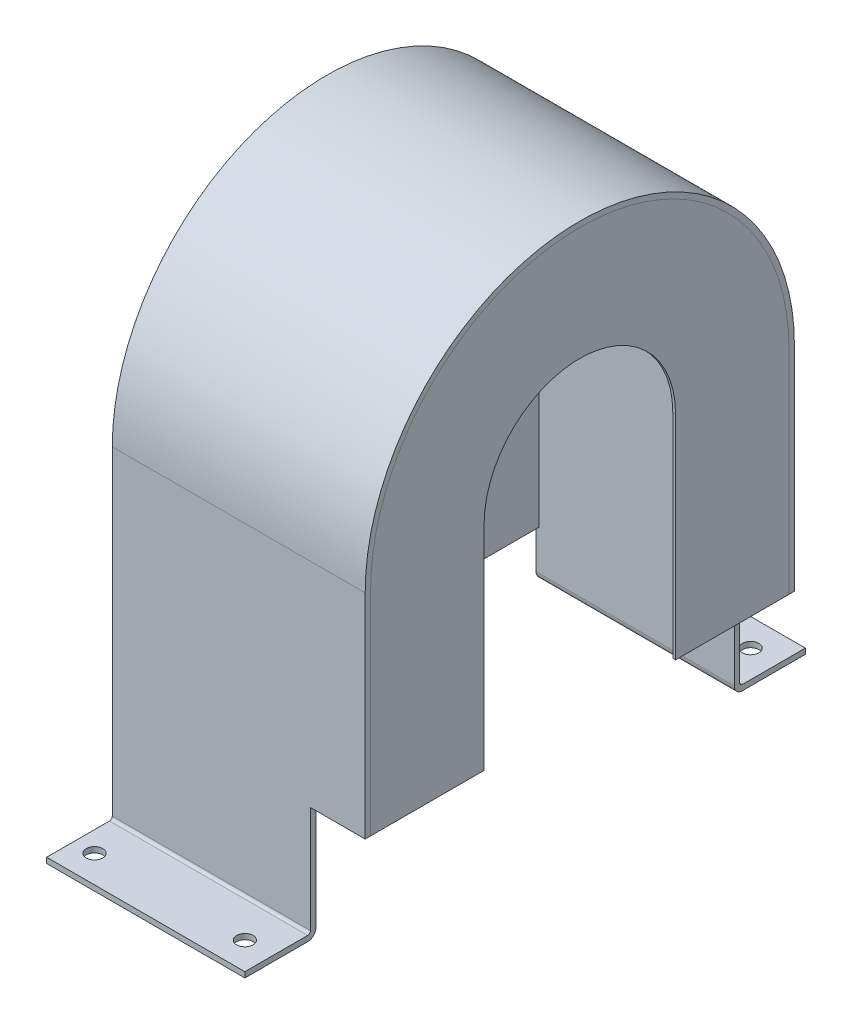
from build123d import *

# Parameters (mm, degrees)
BOSS_EXTRUDE1_DEPTH     = 92.5
SKETCH2_R               = 70
BOSS_EXTRUDE2_DEPTH     = 2
SKETCH3_R               = 6
CUT_EXTRUDE1_DEPTH      = 453.802661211
SKETCH4_W               = 140
SKETCH4_H               = 205
CUT_EXTRUDE2_DEPTH      = 366.855162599
CUT_EXTRUDE3_DEPTH      = 80
CUT_EXTRUDE3_DEPTH_BACK = 10
SKETCH5_W               = 40
SKETCH5_H               = 410
SKETCH6_W               = 306
SKETCH6_H               = 49
CUT_EXTRUDE4_DEPTH      = 2


with BuildPart() as part:
    # Sketch1 → Boss-Extrude1 (new, symmetric)
    with BuildSketch(Plane(origin=(0, 0, 0), x_dir=(0, 0, -1), z_dir=(1, 0, 0))):
        with BuildLine():
            Line((157, 0), (157, -234))
            ThreePointArc((157, -234), (157.585786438, -235.414213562), (159, -236))
            Line((159, -236), (205, -236))
            Line((205, -236), (205, -240))
            Line((205, -240), (159, -240))
            ThreePointArc((159, -240), (154.757359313, -238.242640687), (153, -234))
            Line((153, -234), (153, 0))
            ThreePointArc((153, 0), (0, 153), (-153, 0))
            Line((-153, 0), (-153, -234))
            ThreePointArc((-153, -234), (-154.757359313, -238.242640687), (-159, -240))
            Line((-159, -240), (-205, -240))
            Line((-205, -240), (-205, -236))
            Line((-205, -236), (-159, -236))
            ThreePointArc((-159, -236), (-157.585786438, -235.414213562), (-157, -234))
            Line((-157, -234), (-157, 0))
            ThreePointArc((-157, 0), (0, 157), (157, 0))
        make_face()
    extrude(amount=BOSS_EXTRUDE1_DEPTH, both=True)

    # Sketch3 → Cut-Extrude1 (cut, through all)
    with BuildSketch(Plane(origin=(0, -236, 0), x_dir=(1, 0, 0), z_dir=(0, 1, 0))):
        with Locations(Location((-77.5, -185, 0), (0, 0, 270))):
            Circle(SKETCH3_R)
        with Locations(Location((32.5, -185, 0), (0, 0, 270))):
            Circle(SKETCH3_R)
    cut_extrude1 = extrude(amount=-CUT_EXTRUDE1_DEPTH, mode=Mode.SUBTRACT)

    # Mirror5: Cut-Extrude1 across plane
    add(cut_extrude1.mirror(Plane.XY), mode=Mode.SUBTRACT)

    # Sketch5 → Cut-Extrude3 (cut, two sides: drawn at the far end of the back side and taken through both)
    with BuildSketch(Plane(origin=(0, -236, 0), x_dir=(1, 0, 0), z_dir=(0, 1, 0)).offset(-CUT_EXTRUDE3_DEPTH_BACK)):
        with Locations((72.5, 0)):
            Rectangle(SKETCH5_W, SKETCH5_H)
    extrude(amount=CUT_EXTRUDE3_DEPTH + CUT_EXTRUDE3_DEPTH_BACK, mode=Mode.SUBTRACT)


with BuildPart() as body_2:
    # Sketch2 → Boss-Extrude2 (new body)
    with BuildSketch(Plane(origin=(92.5, 0, 0), x_dir=(0, 0, -1), z_dir=(1, 0, 0))):
        with BuildLine():
            Line((-153, 0), (-153, -205))
            Line((-153, -205), (153, -205))
            Line((153, -205), (153, 0))
            ThreePointArc((153, 0), (0, 153), (-153, 0))
        make_face()
        Circle(SKETCH2_R, mode=Mode.SUBTRACT)
    extrude(amount=-BOSS_EXTRUDE2_DEPTH)


with BuildPart() as body_3:
    # Mirror4: mirrored copy
    add(body_2.part.mirror(Plane(origin=(0, 0, 0), x_dir=(0, 0, 1), z_dir=(1, 0, 0))))


with BuildPart() as cut_extrude2_tool:
    # Sketch4 → Cut-Extrude2 (new, through all)
    with BuildSketch(Plane.ZY.offset(92.5)):
        with Locations((0, -102.5)):
            Rectangle(SKETCH4_W, SKETCH4_H)
    extrude(amount=-CUT_EXTRUDE2_DEPTH)


with BuildPart() as body_2_1:
    add(body_2.part)

    # Cut-Extrude2: cut by cut_extrude2_tool
    add(cut_extrude2_tool.part, mode=Mode.SUBTRACT)

    # Sketch6 → Cut-Extrude4 (cut)
    with BuildSketch(Plane(origin=(92.5, 0, 0), x_dir=(0, 0, -1), z_dir=(1, 0, 0))):
        with Locations((0, -180.5)):
            Rectangle(SKETCH6_W, SKETCH6_H)
    extrude(amount=-CUT_EXTRUDE4_DEPTH, mode=Mode.SUBTRACT)


with BuildPart() as body_3_1:
    add(body_3.part)

    # Cut-Extrude2: cut by cut_extrude2_tool
    add(cut_extrude2_tool.part, mode=Mode.SUBTRACT)


solid = Compound([part.part, body_2_1.part, body_3_1.part])
